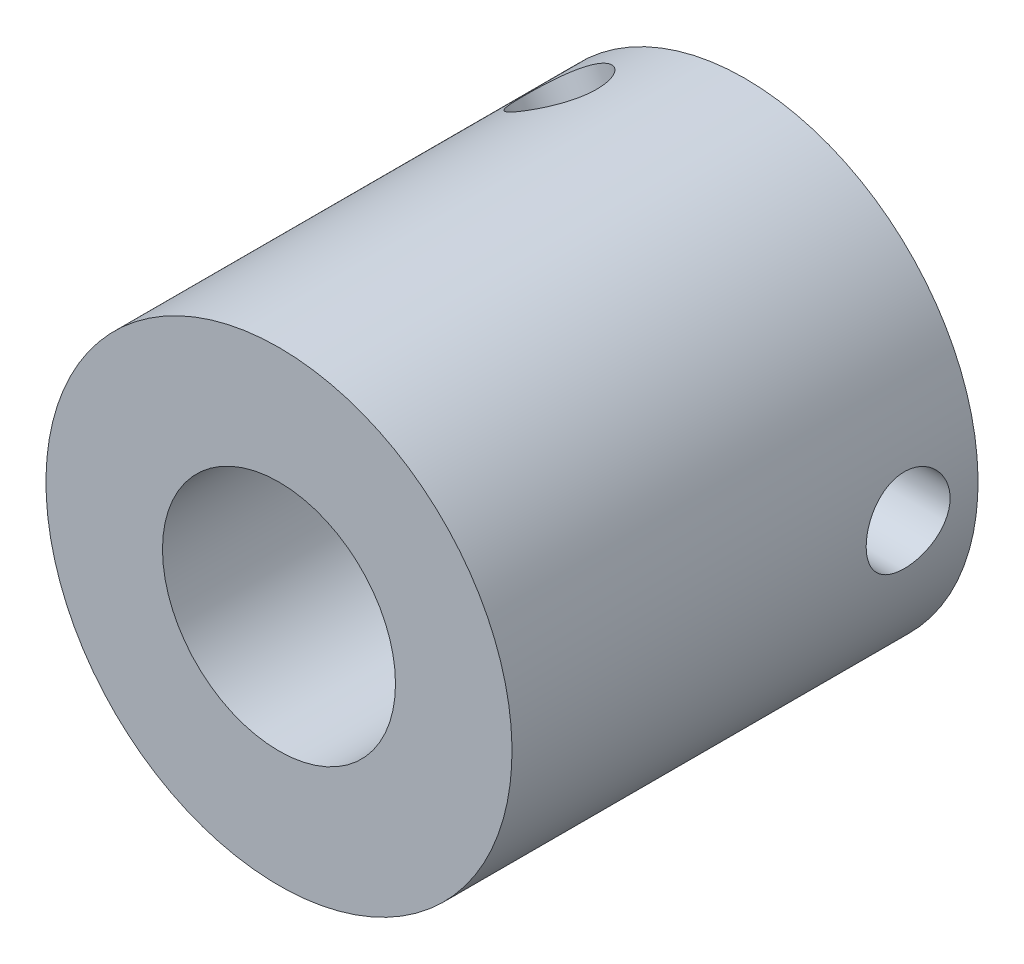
ISO-10303-21;
HEADER;
FILE_DESCRIPTION(('STEP AP214'),'2;1');
FILE_NAME('part.step','',(''),(''),'','','');
FILE_SCHEMA(('AUTOMOTIVE_DESIGN { 1 0 10303 214 1 1 1 1 }'));
ENDSEC;
DATA;
#1=APPLICATION_CONTEXT('core data for automotive mechanical design processes');
#2=APPLICATION_PROTOCOL_DEFINITION('international standard','automotive_design',2000,#1);
#3=PRODUCT_CONTEXT('',#1,'mechanical');
#4=PRODUCT('Part','Part','',(#3));
#5=PRODUCT_RELATED_PRODUCT_CATEGORY('part','',(#4));
#6=PRODUCT_DEFINITION_FORMATION('','',#4);
#7=PRODUCT_DEFINITION_CONTEXT('part definition',#1,'design');
#8=PRODUCT_DEFINITION('design','',#6,#7);
#9=PRODUCT_DEFINITION_SHAPE('','',#8);
#10=(LENGTH_UNIT() NAMED_UNIT(*) SI_UNIT(.MILLI.,.METRE.));
#11=(NAMED_UNIT(*) PLANE_ANGLE_UNIT() SI_UNIT($,.RADIAN.));
#12=(NAMED_UNIT(*) SI_UNIT($,.STERADIAN.) SOLID_ANGLE_UNIT());
#13=UNCERTAINTY_MEASURE_WITH_UNIT(LENGTH_MEASURE(1.E-05),#10,'distance_accuracy_value','');
#14=(GEOMETRIC_REPRESENTATION_CONTEXT(3) GLOBAL_UNCERTAINTY_ASSIGNED_CONTEXT((#13)) GLOBAL_UNIT_ASSIGNED_CONTEXT((#10,
#11,#12)) REPRESENTATION_CONTEXT('',''));
#15=CARTESIAN_POINT('',(0.,0.,0.));
#16=DIRECTION('',(0.,0.,1.));
#17=DIRECTION('',(1.,0.,0.));
#18=AXIS2_PLACEMENT_3D('',#15,#16,#17);
#19=CARTESIAN_POINT('',(10.,0.,3.));
#20=DIRECTION('',(1.,0.,0.));
#21=DIRECTION('',(0.,0.,1.));
#22=AXIS2_PLACEMENT_3D('',#19,#20,#21);
#23=CYLINDRICAL_SURFACE('',#22,1.8);
#24=CARTESIAN_POINT('',(5.,0.,4.8));
#25=CARTESIAN_POINT('',(5.00000162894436,0.0977539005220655,4.80000224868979));
#26=CARTESIAN_POINT('',(4.99710773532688,0.19549186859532,4.79201150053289));
#27=CARTESIAN_POINT('',(4.98585098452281,0.388062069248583,4.7603771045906));
#28=CARTESIAN_POINT('',(4.97748842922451,0.482894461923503,4.73673432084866));
#29=CARTESIAN_POINT('',(4.95619614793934,0.666849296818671,4.67473007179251));
#30=CARTESIAN_POINT('',(4.94327480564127,0.755981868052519,4.63639561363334));
#31=CARTESIAN_POINT('',(4.91416362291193,0.92654826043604,4.54622789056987));
#32=CARTESIAN_POINT('',(4.89797298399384,1.00798019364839,4.49439132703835));
#33=CARTESIAN_POINT('',(4.86328998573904,1.1640588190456,4.37654202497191));
#34=CARTESIAN_POINT('',(4.84473608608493,1.23835945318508,4.31008922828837));
#35=CARTESIAN_POINT('',(4.8077334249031,1.37503534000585,4.16582831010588));
#36=CARTESIAN_POINT('',(4.78928469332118,1.43740734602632,4.08801710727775));
#37=CARTESIAN_POINT('',(4.75387995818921,1.55057074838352,3.91996655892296));
#38=CARTESIAN_POINT('',(4.73699749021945,1.60088792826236,3.82939085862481));
#39=CARTESIAN_POINT('',(4.70758621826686,1.6854228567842,3.64035790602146));
#40=CARTESIAN_POINT('',(4.69505583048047,1.71964646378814,3.54190353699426));
#41=CARTESIAN_POINT('',(4.6764216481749,1.76968160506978,3.34387619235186));
#42=CARTESIAN_POINT('',(4.67008963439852,1.78614945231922,3.24449121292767));
#43=CARTESIAN_POINT('',(4.66389839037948,1.80225793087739,3.0441824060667));
#44=CARTESIAN_POINT('',(4.66403674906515,1.80190483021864,2.94325916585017));
#45=CARTESIAN_POINT('',(4.67057263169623,1.78488611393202,2.74858544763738));
#46=CARTESIAN_POINT('',(4.67662885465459,1.76910996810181,2.65474367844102));
#47=CARTESIAN_POINT('',(4.69375412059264,1.7231561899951,2.47114129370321));
#48=CARTESIAN_POINT('',(4.70482385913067,1.69297655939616,2.38138124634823));
#49=CARTESIAN_POINT('',(4.73094806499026,1.61855003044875,2.20660082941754));
#50=CARTESIAN_POINT('',(4.74607046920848,1.57406042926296,2.12169440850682));
#51=CARTESIAN_POINT('',(4.77857129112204,1.47244565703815,1.96028560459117));
#52=CARTESIAN_POINT('',(4.79595044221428,1.41531637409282,1.88378596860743));
#53=CARTESIAN_POINT('',(4.83231258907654,1.2858992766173,1.73640984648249));
#54=CARTESIAN_POINT('',(4.85132846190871,1.21289487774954,1.66616928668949));
#55=CARTESIAN_POINT('',(4.88789590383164,1.05591731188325,1.53874730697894));
#56=CARTESIAN_POINT('',(4.90544728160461,0.971942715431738,1.48156759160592));
#57=CARTESIAN_POINT('',(4.9374100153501,0.793888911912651,1.38126165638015));
#58=CARTESIAN_POINT('',(4.95177667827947,0.699690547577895,1.33833171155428));
#59=CARTESIAN_POINT('',(4.97542272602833,0.504764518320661,1.26913413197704));
#60=CARTESIAN_POINT('',(4.9847041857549,0.404039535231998,1.2428597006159));
#61=CARTESIAN_POINT('',(4.99677710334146,0.204283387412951,1.20890559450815));
#62=CARTESIAN_POINT('',(4.99986753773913,0.10541586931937,1.20036852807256));
#63=CARTESIAN_POINT('',(5.00012395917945,-0.092375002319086,1.19965509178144));
#64=CARTESIAN_POINT('',(4.997291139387,-0.191298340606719,1.2074754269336));
#65=CARTESIAN_POINT('',(4.98621692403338,-0.382789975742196,1.23859238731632));
#66=CARTESIAN_POINT('',(4.97816730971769,-0.47545961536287,1.26134058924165));
#67=CARTESIAN_POINT('',(4.95766056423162,-0.655612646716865,1.32095908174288));
#68=CARTESIAN_POINT('',(4.9452028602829,-0.743095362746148,1.35783120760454));
#69=CARTESIAN_POINT('',(4.916682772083,-0.913170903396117,1.44579751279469));
#70=CARTESIAN_POINT('',(4.90052802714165,-0.995554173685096,1.49726600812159));
#71=CARTESIAN_POINT('',(4.86641871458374,-1.15078022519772,1.61253526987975));
#72=CARTESIAN_POINT('',(4.84846352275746,-1.22361967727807,1.6763403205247));
#73=CARTESIAN_POINT('',(4.811551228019,-1.3617486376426,1.81848564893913));
#74=CARTESIAN_POINT('',(4.7925917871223,-1.42642787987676,1.89741985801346));
#75=CARTESIAN_POINT('',(4.75675694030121,-1.54172624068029,2.06541026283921));
#76=CARTESIAN_POINT('',(4.73988164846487,-1.5923445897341,2.15446701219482));
#77=CARTESIAN_POINT('',(4.71023855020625,-1.67801139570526,2.34061713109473));
#78=CARTESIAN_POINT('',(4.69747699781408,-1.71303617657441,2.43772245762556));
#79=CARTESIAN_POINT('',(4.6778137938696,-1.76603303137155,2.63703300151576));
#80=CARTESIAN_POINT('',(4.67090889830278,-1.78401454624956,2.73923536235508));
#81=CARTESIAN_POINT('',(4.66414933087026,-1.80160793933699,2.93928552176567));
#82=CARTESIAN_POINT('',(4.66389931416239,-1.80224993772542,3.03703021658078));
#83=CARTESIAN_POINT('',(4.66947753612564,-1.7877467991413,3.2311552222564));
#84=CARTESIAN_POINT('',(4.67530528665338,-1.77260293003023,3.32753564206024));
#85=CARTESIAN_POINT('',(4.69206559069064,-1.7277347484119,3.51367900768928));
#86=CARTESIAN_POINT('',(4.70286203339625,-1.69839819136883,3.60354868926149));
#87=CARTESIAN_POINT('',(4.72827416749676,-1.62630780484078,3.77715042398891));
#88=CARTESIAN_POINT('',(4.74289078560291,-1.58355071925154,3.86088098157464));
#89=CARTESIAN_POINT('',(4.77519415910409,-1.48338009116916,4.02431309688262));
#90=CARTESIAN_POINT('',(4.79299679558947,-1.42534759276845,4.10361214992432));
#91=CARTESIAN_POINT('',(4.82923722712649,-1.29726372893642,4.25167713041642));
#92=CARTESIAN_POINT('',(4.84767521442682,-1.22720869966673,4.32043983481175));
#93=CARTESIAN_POINT('',(4.88417774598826,-1.07301971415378,4.44885088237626));
#94=CARTESIAN_POINT('',(4.90218131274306,-0.988369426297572,4.50789912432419));
#95=CARTESIAN_POINT('',(4.93483332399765,-0.809724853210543,4.61089182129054));
#96=CARTESIAN_POINT('',(4.94948194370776,-0.715731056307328,4.65483706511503));
#97=CARTESIAN_POINT('',(4.97387564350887,-0.519977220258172,4.72643874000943));
#98=CARTESIAN_POINT('',(4.98356860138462,-0.418147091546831,4.75392253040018));
#99=CARTESIAN_POINT('',(4.99662861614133,-0.21087080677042,4.79069825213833));
#100=CARTESIAN_POINT('',(4.99999824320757,-0.105426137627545,4.79999757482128));
#101=CARTESIAN_POINT('',(5.,0.,4.8));
#102=B_SPLINE_CURVE_WITH_KNOTS('',3,(#24,#25,#26,#27,#28,#29,#30,#31,#32,#33,#34,#35,#36,#37,
#38,#39,#40,#41,#42,#43,#44,#45,#46,#47,#48,#49,#50,#51,#52,#53,#54,#55,#56,#57,#58,#59,#60,#61,
#62,#63,#64,#65,#66,#67,#68,#69,#70,#71,#72,#73,#74,#75,#76,#77,#78,#79,#80,#81,#82,#83,#84,#85,
#86,#87,#88,#89,#90,#91,#92,#93,#94,#95,#96,#97,#98,#99,#100,#101),.UNSPECIFIED.,.T.,.F.,(4,2,2,
2,2,2,2,2,2,2,2,2,2,2,2,2,2,2,2,2,2,2,2,2,2,2,2,2,2,2,2,2,2,2,2,2,2,2,4),(0.,0.292873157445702,
0.585730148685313,0.87805135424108,1.17044404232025,1.47327609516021,1.77619045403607,
2.08956388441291,2.40282315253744,2.70405814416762,3.00518088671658,3.28990369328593,
3.57466601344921,3.86453804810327,4.15450452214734,4.46231862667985,4.77017288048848,
5.08210674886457,5.39391324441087,5.69025938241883,5.98654583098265,6.27251452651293,
6.55852039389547,6.85265234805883,7.14688663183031,7.45682137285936,7.76677307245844,
8.07719378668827,8.38744244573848,8.67921628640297,8.97096669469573,9.25516146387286,
9.5394252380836,9.83771174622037,10.136089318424,10.4488683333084,10.7616310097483,
11.0776188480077,11.3934782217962),.UNSPECIFIED.);
#103=CARTESIAN_POINT('',(5.,0.,4.8));
#104=VERTEX_POINT('',#103);
#105=EDGE_CURVE('E37',#104,#104,#102,.T.);
#106=ORIENTED_EDGE('',*,*,#105,.T.);
#107=EDGE_LOOP('',(#106));
#108=FACE_BOUND('',#107,.T.);
#109=CARTESIAN_POINT('',(10.,0.,1.2));
#110=CARTESIAN_POINT('',(9.99999792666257,-0.100138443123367,1.20000468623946));
#111=CARTESIAN_POINT('',(9.99847890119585,-0.200403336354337,1.20839204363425));
#112=CARTESIAN_POINT('',(9.99256124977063,-0.398189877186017,1.2417225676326));
#113=CARTESIAN_POINT('',(9.98815683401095,-0.495705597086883,1.26669902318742));
#114=CARTESIAN_POINT('',(9.97696172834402,-0.684989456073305,1.33242473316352));
#115=CARTESIAN_POINT('',(9.9701741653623,-0.776764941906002,1.37315332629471));
#116=CARTESIAN_POINT('',(9.95495763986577,-0.952142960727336,1.46917704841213));
#117=CARTESIAN_POINT('',(9.9465292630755,-1.03574839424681,1.52446698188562));
#118=CARTESIAN_POINT('',(9.92885621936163,-1.19338882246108,1.64870648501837));
#119=CARTESIAN_POINT('',(9.91960421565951,-1.26731946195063,1.7177874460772));
#120=CARTESIAN_POINT('',(9.90138142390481,-1.40261092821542,1.86736851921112));
#121=CARTESIAN_POINT('',(9.89241066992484,-1.46397023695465,1.94787000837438));
#122=CARTESIAN_POINT('',(9.87569637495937,-1.57279517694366,2.11872462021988));
#123=CARTESIAN_POINT('',(9.86796217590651,-1.6201571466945,2.20914476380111));
#124=CARTESIAN_POINT('',(9.85469826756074,-1.69897904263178,2.39681974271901));
#125=CARTESIAN_POINT('',(9.84916836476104,-1.73044036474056,2.49407397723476));
#126=CARTESIAN_POINT('',(9.84101185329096,-1.77623939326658,2.6915561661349));
#127=CARTESIAN_POINT('',(9.8383548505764,-1.79075649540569,2.79174123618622));
#128=CARTESIAN_POINT('',(9.83615323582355,-1.80281159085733,2.99315783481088));
#129=CARTESIAN_POINT('',(9.83660837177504,-1.80035095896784,3.09438927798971));
#130=CARTESIAN_POINT('',(9.84055190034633,-1.77866619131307,3.29373143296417));
#131=CARTESIAN_POINT('',(9.84400352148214,-1.75964526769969,3.39186508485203));
#132=CARTESIAN_POINT('',(9.85349347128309,-1.70569919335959,3.5835259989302));
#133=CARTESIAN_POINT('',(9.85953192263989,-1.67077328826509,3.67705304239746));
#134=CARTESIAN_POINT('',(9.87355429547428,-1.58580593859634,3.85744754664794));
#135=CARTESIAN_POINT('',(9.88154890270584,-1.53568109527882,3.94427486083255));
#136=CARTESIAN_POINT('',(9.89857482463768,-1.42180184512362,4.10835629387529));
#137=CARTESIAN_POINT('',(9.90760615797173,-1.35804719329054,4.18561024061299));
#138=CARTESIAN_POINT('',(9.92584751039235,-1.21763063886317,4.32952111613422));
#139=CARTESIAN_POINT('',(9.93505823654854,-1.14079701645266,4.39601049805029));
#140=CARTESIAN_POINT('',(9.95250580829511,-0.976936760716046,4.51520980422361));
#141=CARTESIAN_POINT('',(9.96074222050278,-0.889905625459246,4.56791360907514));
#142=CARTESIAN_POINT('',(9.97532870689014,-0.707929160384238,4.65806284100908));
#143=CARTESIAN_POINT('',(9.98167520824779,-0.612969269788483,4.69547941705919));
#144=CARTESIAN_POINT('',(9.99172969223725,-0.418096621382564,4.75370936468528));
#145=CARTESIAN_POINT('',(9.99544322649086,-0.318194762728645,4.77455768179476));
#146=CARTESIAN_POINT('',(9.99842222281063,-0.181296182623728,4.79121663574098));
#147=CARTESIAN_POINT('',(9.99901260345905,-0.145122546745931,4.79450767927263));
#148=CARTESIAN_POINT('',(9.99980186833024,-0.0726381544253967,4.7989002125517));
#149=CARTESIAN_POINT('',(10.0000007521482,-0.0363273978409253,4.80000170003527));
#150=CARTESIAN_POINT('',(9.99999792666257,0.100138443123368,4.79999531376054));
#151=CARTESIAN_POINT('',(9.99847890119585,0.200403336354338,4.79160795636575));
#152=CARTESIAN_POINT('',(9.99256124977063,0.398189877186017,4.7582774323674));
#153=CARTESIAN_POINT('',(9.98815683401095,0.495705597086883,4.73330097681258));
#154=CARTESIAN_POINT('',(9.97696172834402,0.684989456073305,4.66757526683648));
#155=CARTESIAN_POINT('',(9.9701741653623,0.776764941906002,4.62684667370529));
#156=CARTESIAN_POINT('',(9.95495763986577,0.952142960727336,4.53082295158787));
#157=CARTESIAN_POINT('',(9.9465292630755,1.03574839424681,4.47553301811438));
#158=CARTESIAN_POINT('',(9.92885621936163,1.19338882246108,4.35129351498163));
#159=CARTESIAN_POINT('',(9.91960421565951,1.26731946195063,4.2822125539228));
#160=CARTESIAN_POINT('',(9.90138142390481,1.40261092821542,4.13263148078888));
#161=CARTESIAN_POINT('',(9.89241066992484,1.46397023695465,4.05212999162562));
#162=CARTESIAN_POINT('',(9.87569637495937,1.57279517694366,3.88127537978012));
#163=CARTESIAN_POINT('',(9.86796217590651,1.6201571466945,3.79085523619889));
#164=CARTESIAN_POINT('',(9.85469826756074,1.69897904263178,3.60318025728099));
#165=CARTESIAN_POINT('',(9.84916836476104,1.73044036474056,3.50592602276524));
#166=CARTESIAN_POINT('',(9.84101185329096,1.77623939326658,3.3084438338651));
#167=CARTESIAN_POINT('',(9.8383548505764,1.79075649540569,3.20825876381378));
#168=CARTESIAN_POINT('',(9.83615323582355,1.80281159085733,3.00684216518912));
#169=CARTESIAN_POINT('',(9.83660837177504,1.80035095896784,2.90561072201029));
#170=CARTESIAN_POINT('',(9.84055190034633,1.77866619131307,2.70626856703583));
#171=CARTESIAN_POINT('',(9.84400352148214,1.75964526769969,2.60813491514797));
#172=CARTESIAN_POINT('',(9.85349347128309,1.70569919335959,2.4164740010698));
#173=CARTESIAN_POINT('',(9.85953192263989,1.67077328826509,2.32294695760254));
#174=CARTESIAN_POINT('',(9.87355429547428,1.58580593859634,2.14255245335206));
#175=CARTESIAN_POINT('',(9.88154890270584,1.53568109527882,2.05572513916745));
#176=CARTESIAN_POINT('',(9.89857482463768,1.42180184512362,1.89164370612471));
#177=CARTESIAN_POINT('',(9.90760615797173,1.35804719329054,1.81438975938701));
#178=CARTESIAN_POINT('',(9.92584751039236,1.21763063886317,1.67047888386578));
#179=CARTESIAN_POINT('',(9.93505823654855,1.14079701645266,1.60398950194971));
#180=CARTESIAN_POINT('',(9.95250580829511,0.976936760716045,1.48479019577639));
#181=CARTESIAN_POINT('',(9.96074222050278,0.889905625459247,1.43208639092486));
#182=CARTESIAN_POINT('',(9.97532870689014,0.707929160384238,1.34193715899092));
#183=CARTESIAN_POINT('',(9.98167520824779,0.612969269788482,1.30452058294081));
#184=CARTESIAN_POINT('',(9.99172969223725,0.418096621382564,1.24629063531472));
#185=CARTESIAN_POINT('',(9.99544322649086,0.318194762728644,1.22544231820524));
#186=CARTESIAN_POINT('',(9.99842222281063,0.181296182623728,1.20878336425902));
#187=CARTESIAN_POINT('',(9.99901260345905,0.145122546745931,1.20549232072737));
#188=CARTESIAN_POINT('',(9.99980186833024,0.0726381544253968,1.2010997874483));
#189=CARTESIAN_POINT('',(10.0000007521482,0.0363273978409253,1.19999829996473));
#190=CARTESIAN_POINT('',(10.,0.,1.2));
#191=B_SPLINE_CURVE_WITH_KNOTS('',3,(#109,#110,#111,#112,#113,#114,#115,#116,#117,#118,#119,
#120,#121,#122,#123,#124,#125,#126,#127,#128,#129,#130,#131,#132,#133,#134,#135,#136,#137,#138,
#139,#140,#141,#142,#143,#144,#145,#146,#147,#148,#149,#150,#151,#152,#153,#154,#155,#156,#157,
#158,#159,#160,#161,#162,#163,#164,#165,#166,#167,#168,#169,#170,#171,#172,#173,#174,#175,#176,
#177,#178,#179,#180,#181,#182,#183,#184,#185,#186,#187,#188,#189,#190),.UNSPECIFIED.,.T.,.F.,(4,
2,2,2,2,2,2,2,2,2,2,2,2,2,2,2,2,2,2,2,2,2,2,2,2,2,2,2,2,2,2,2,2,2,2,2,2,2,2,2,4),(0.,
0.300276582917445,0.601157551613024,0.901645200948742,1.20202578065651,1.50541792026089,
1.808846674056,2.11446927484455,2.42006504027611,2.72239510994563,3.02470069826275,
3.3233481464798,3.62200976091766,3.92234077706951,4.22267719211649,4.52731338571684,
4.83208457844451,5.13742832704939,5.44212632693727,5.55105807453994,5.65998993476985,
5.9602665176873,6.26114748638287,6.56163513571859,6.86201571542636,7.16540785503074,
7.46883660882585,7.7744592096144,8.08005497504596,8.38238504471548,8.6846906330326,
8.98333808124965,9.28199969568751,9.58233071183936,9.88266712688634,10.1873033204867,
10.4920745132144,10.7974182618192,11.1021162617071,11.2110480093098,11.3199798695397),.UNSPECIFIED.);
#192=CARTESIAN_POINT('',(10.,0.,1.2));
#193=VERTEX_POINT('',#192);
#194=EDGE_CURVE('E53',#193,#193,#191,.T.);
#195=ORIENTED_EDGE('',*,*,#194,.F.);
#196=EDGE_LOOP('',(#195));
#197=FACE_BOUND('',#196,.T.);
#198=ADVANCED_FACE('F12',(#108,#197),#23,.F.);
#199=CARTESIAN_POINT('',(0.,0.,20.));
#200=DIRECTION('',(0.,0.,1.));
#201=DIRECTION('',(0.,-1.,0.));
#202=AXIS2_PLACEMENT_3D('',#199,#200,#201);
#203=PLANE('',#202);
#204=CARTESIAN_POINT('',(0.,0.,20.));
#205=DIRECTION('',(0.,0.,1.));
#206=DIRECTION('',(1.,0.,0.));
#207=AXIS2_PLACEMENT_3D('',#204,#205,#206);
#208=CIRCLE('',#207,5.);
#209=CARTESIAN_POINT('',(5.,0.,20.));
#210=VERTEX_POINT('',#209);
#211=EDGE_CURVE('E74',#210,#210,#208,.T.);
#212=ORIENTED_EDGE('',*,*,#211,.F.);
#213=EDGE_LOOP('',(#212));
#214=FACE_BOUND('',#213,.T.);
#215=CARTESIAN_POINT('',(0.,0.,20.));
#216=DIRECTION('',(0.,0.,-1.));
#217=DIRECTION('',(0.,1.,0.));
#218=AXIS2_PLACEMENT_3D('',#215,#216,#217);
#219=CIRCLE('',#218,10.);
#220=CARTESIAN_POINT('',(0.,10.,20.));
#221=VERTEX_POINT('',#220);
#222=EDGE_CURVE('E30',#221,#221,#219,.T.);
#223=ORIENTED_EDGE('',*,*,#222,.F.);
#224=EDGE_LOOP('',(#223));
#225=FACE_BOUND('',#224,.T.);
#226=ADVANCED_FACE('F61',(#214,#225),#203,.T.);
#227=CARTESIAN_POINT('',(0.,0.,0.));
#228=DIRECTION('',(0.,0.,1.));
#229=DIRECTION('',(0.,-1.,0.));
#230=AXIS2_PLACEMENT_3D('',#227,#228,#229);
#231=PLANE('',#230);
#232=CARTESIAN_POINT('',(0.,0.,0.));
#233=DIRECTION('',(0.,0.,1.));
#234=DIRECTION('',(1.,0.,0.));
#235=AXIS2_PLACEMENT_3D('',#232,#233,#234);
#236=CIRCLE('',#235,5.);
#237=CARTESIAN_POINT('',(5.,0.,0.));
#238=VERTEX_POINT('',#237);
#239=EDGE_CURVE('E76',#238,#238,#236,.T.);
#240=ORIENTED_EDGE('',*,*,#239,.T.);
#241=EDGE_LOOP('',(#240));
#242=FACE_BOUND('',#241,.T.);
#243=CARTESIAN_POINT('',(0.,0.,0.));
#244=DIRECTION('',(0.,0.,-1.));
#245=DIRECTION('',(0.,1.,0.));
#246=AXIS2_PLACEMENT_3D('',#243,#244,#245);
#247=CIRCLE('',#246,10.);
#248=CARTESIAN_POINT('',(0.,10.,0.));
#249=VERTEX_POINT('',#248);
#250=EDGE_CURVE('E25',#249,#249,#247,.F.);
#251=ORIENTED_EDGE('',*,*,#250,.F.);
#252=EDGE_LOOP('',(#251));
#253=FACE_BOUND('',#252,.T.);
#254=ADVANCED_FACE('F63',(#242,#253),#231,.F.);
#255=CARTESIAN_POINT('',(-5.,8.66025403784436,3.));
#256=DIRECTION('',(-0.5,0.866025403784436,0.));
#257=DIRECTION('',(-0.866025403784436,-0.5,0.));
#258=AXIS2_PLACEMENT_3D('',#255,#256,#257);
#259=CYLINDRICAL_SURFACE('',#258,1.8);
#260=CARTESIAN_POINT('',(-3.89122648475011,3.13980197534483,3.));
#261=CARTESIAN_POINT('',(-3.89122747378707,3.13979901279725,2.90247845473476));
#262=CARTESIAN_POINT('',(-3.88588566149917,3.14645523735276,2.80497297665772));
#263=CARTESIAN_POINT('',(-3.8646073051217,3.1725524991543,2.61288304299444));
#264=CARTESIAN_POINT('',(-3.84867037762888,3.19199399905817,2.51829869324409));
#265=CARTESIAN_POINT('',(-3.80646681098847,3.24220172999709,2.33487248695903));
#266=CARTESIAN_POINT('',(-3.78022320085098,3.27294270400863,2.24601833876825));
#267=CARTESIAN_POINT('',(-3.71767295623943,3.3438203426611,2.07592991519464));
#268=CARTESIAN_POINT('',(-3.68136357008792,3.38395957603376,1.99469773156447));
#269=CARTESIAN_POINT('',(-3.59725267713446,3.47328119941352,1.83844389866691));
#270=CARTESIAN_POINT('',(-3.54903622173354,3.52277012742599,1.76382074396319));
#271=CARTESIAN_POINT('',(-3.4423905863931,3.62705163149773,1.62650840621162));
#272=CARTESIAN_POINT('',(-3.38395944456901,3.68184522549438,1.56382152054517));
#273=CARTESIAN_POINT('',(-3.25553209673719,3.79593239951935,1.45028357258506));
#274=CARTESIAN_POINT('',(-3.18523343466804,3.85531283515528,1.39985984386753));
#275=CARTESIAN_POINT('',(-3.03560156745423,3.97419621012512,1.31512692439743));
#276=CARTESIAN_POINT('',(-2.95627124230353,4.03369910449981,1.28081261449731));
#277=CARTESIAN_POINT('',(-2.79374684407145,4.14782328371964,1.23065284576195));
#278=CARTESIAN_POINT('',(-2.7108348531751,4.20254463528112,1.21412260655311));
#279=CARTESIAN_POINT('',(-2.54067690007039,4.30754492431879,1.197812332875));
#280=CARTESIAN_POINT('',(-2.45343224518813,4.35782518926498,1.19802727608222));
#281=CARTESIAN_POINT('',(-2.2813937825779,4.45020762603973,1.21478918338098));
#282=CARTESIAN_POINT('',(-2.19666990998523,4.49257835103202,1.23059012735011));
#283=CARTESIAN_POINT('',(-2.02833233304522,4.57104984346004,1.27682852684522));
#284=CARTESIAN_POINT('',(-1.94471870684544,4.6071501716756,1.30726700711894));
#285=CARTESIAN_POINT('',(-1.7799513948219,4.67330425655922,1.3822951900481));
#286=CARTESIAN_POINT('',(-1.69884909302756,4.70326546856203,1.42707858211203));
#287=CARTESIAN_POINT('',(-1.54276654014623,4.75675187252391,1.52935870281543));
#288=CARTESIAN_POINT('',(-1.46778818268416,4.78027507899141,1.58685934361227));
#289=CARTESIAN_POINT('',(-1.32235790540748,4.82259435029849,1.71659889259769));
#290=CARTESIAN_POINT('',(-1.25237303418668,4.84106426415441,1.78946867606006));
#291=CARTESIAN_POINT('',(-1.12420364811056,4.87242549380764,1.94602011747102));
#292=CARTESIAN_POINT('',(-1.0660216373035,4.88531562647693,2.02970406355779));
#293=CARTESIAN_POINT('',(-0.96288381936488,4.90669867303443,2.20758130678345));
#294=CARTESIAN_POINT('',(-0.918200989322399,4.91510317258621,2.30194439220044));
#295=CARTESIAN_POINT('',(-0.845904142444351,4.92806364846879,2.49723850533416));
#296=CARTESIAN_POINT('',(-0.818281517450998,4.93262156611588,2.59816619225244));
#297=CARTESIAN_POINT('',(-0.782686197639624,4.93839170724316,2.79815389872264));
#298=CARTESIAN_POINT('',(-0.773773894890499,4.93976429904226,2.89704196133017));
#299=CARTESIAN_POINT('',(-0.773305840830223,4.93983813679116,3.09484795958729));
#300=CARTESIAN_POINT('',(-0.781746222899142,4.93853997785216,3.19376588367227));
#301=CARTESIAN_POINT('',(-0.814746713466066,4.9331980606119,3.38443869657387));
#302=CARTESIAN_POINT('',(-0.838608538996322,4.92927298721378,3.47631949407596));
#303=CARTESIAN_POINT('',(-0.900561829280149,4.91833009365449,3.65494767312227));
#304=CARTESIAN_POINT('',(-0.938656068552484,4.91131167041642,3.74169404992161));
#305=CARTESIAN_POINT('',(-1.0289969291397,4.89319462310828,3.91100910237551));
#306=CARTESIAN_POINT('',(-1.08169771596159,4.88196007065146,3.9933203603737));
#307=CARTESIAN_POINT('',(-1.1985231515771,4.85459952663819,4.14849310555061));
#308=CARTESIAN_POINT('',(-1.26265168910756,4.83847186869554,4.22135136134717));
#309=CARTESIAN_POINT('',(-1.40413758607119,4.79938321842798,4.35989644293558));
#310=CARTESIAN_POINT('',(-1.48204407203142,4.7760822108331,4.4249287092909));
#311=CARTESIAN_POINT('',(-1.64552242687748,4.72225068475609,4.54085834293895));
#312=CARTESIAN_POINT('',(-1.73109418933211,4.69172026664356,4.59175590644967));
#313=CARTESIAN_POINT('',(-1.90656947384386,4.62318195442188,4.67757481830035));
#314=CARTESIAN_POINT('',(-1.99644974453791,4.58521138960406,4.71257314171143));
#315=CARTESIAN_POINT('',(-2.17778192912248,4.50191081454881,4.76560985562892));
#316=CARTESIAN_POINT('',(-2.26923315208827,4.4565839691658,4.78365551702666));
#317=CARTESIAN_POINT('',(-2.44558841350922,4.36217374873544,4.80153748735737));
#318=CARTESIAN_POINT('',(-2.53057880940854,4.31342674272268,4.802307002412));
#319=CARTESIAN_POINT('',(-2.69655577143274,4.21165766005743,4.7879786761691));
#320=CARTESIAN_POINT('',(-2.77754275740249,4.15863603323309,4.77288250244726));
#321=CARTESIAN_POINT('',(-2.93173519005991,4.05136693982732,4.72789571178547));
#322=CARTESIAN_POINT('',(-3.00506854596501,3.99716876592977,4.69832318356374));
#323=CARTESIAN_POINT('',(-3.14439654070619,3.88851948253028,4.6255308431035));
#324=CARTESIAN_POINT('',(-3.21038979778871,3.83406832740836,4.58230846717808));
#325=CARTESIAN_POINT('',(-3.336550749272,3.72487212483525,4.48144809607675));
#326=CARTESIAN_POINT('',(-3.39637551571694,3.67020402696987,4.42329838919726));
#327=CARTESIAN_POINT('',(-3.50635300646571,3.56528759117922,4.29506354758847));
#328=CARTESIAN_POINT('',(-3.55650238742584,3.51504078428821,4.22497430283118));
#329=CARTESIAN_POINT('',(-3.64884949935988,3.41914369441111,4.07087091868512));
#330=CARTESIAN_POINT('',(-3.69055452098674,3.37382648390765,3.98635242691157));
#331=CARTESIAN_POINT('',(-3.76249653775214,3.29340906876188,3.8080547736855));
#332=CARTESIAN_POINT('',(-3.79273401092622,3.25830843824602,3.71427599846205));
#333=CARTESIAN_POINT('',(-3.84165865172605,3.20048782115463,3.51895568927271));
#334=CARTESIAN_POINT('',(-3.86022328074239,3.17789946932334,3.41734397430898));
#335=CARTESIAN_POINT('',(-3.88500342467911,3.14756203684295,3.21048064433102));
#336=CARTESIAN_POINT('',(-3.89122541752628,3.13980517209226,3.10523096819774));
#337=CARTESIAN_POINT('',(-3.89122648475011,3.13980197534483,3.));
#338=B_SPLINE_CURVE_WITH_KNOTS('',3,(#260,#261,#262,#263,#264,#265,#266,#267,#268,#269,#270,
#271,#272,#273,#274,#275,#276,#277,#278,#279,#280,#281,#282,#283,#284,#285,#286,#287,#288,#289,
#290,#291,#292,#293,#294,#295,#296,#297,#298,#299,#300,#301,#302,#303,#304,#305,#306,#307,#308,
#309,#310,#311,#312,#313,#314,#315,#316,#317,#318,#319,#320,#321,#322,#323,#324,#325,#326,#327,
#328,#329,#330,#331,#332,#333,#334,#335,#336,#337),.UNSPECIFIED.,.T.,.F.,(4,2,2,2,2,2,2,2,2,2,2,
2,2,2,2,2,2,2,2,2,2,2,2,2,2,2,2,2,2,2,2,2,2,2,2,2,2,2,4),(0.,0.292173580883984,
0.584357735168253,0.875892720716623,1.16750748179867,1.47124350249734,1.77503792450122,
2.08825346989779,2.40136941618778,2.70194221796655,3.00242487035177,3.28919020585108,
3.575975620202,3.86680921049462,4.15773239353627,4.46445707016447,4.77124675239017,
5.08387886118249,5.3963530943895,5.69271819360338,5.98901726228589,6.27275971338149,
6.5565575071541,6.85042427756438,7.14439123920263,7.45528614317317,7.76617673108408,
8.0755456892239,8.38478190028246,8.67727138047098,8.96973012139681,9.25603305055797,
9.54238978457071,9.84031183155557,10.1383366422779,10.4505611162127,10.7627725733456,
11.0782091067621,11.3934800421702),.UNSPECIFIED.);
#339=CARTESIAN_POINT('',(-3.89122648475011,3.13980197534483,3.));
#340=VERTEX_POINT('',#339);
#341=EDGE_CURVE('E16',#340,#340,#338,.T.);
#342=ORIENTED_EDGE('',*,*,#341,.T.);
#343=EDGE_LOOP('',(#342));
#344=FACE_BOUND('',#343,.T.);
#345=CARTESIAN_POINT('',(-6.4771787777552,7.6188027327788,3.));
#346=CARTESIAN_POINT('',(-6.47717580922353,7.61880698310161,2.89987639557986));
#347=CARTESIAN_POINT('',(-6.47068644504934,7.62433700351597,2.79962624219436));
#348=CARTESIAN_POINT('',(-6.44483457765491,7.64620053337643,2.60187040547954));
#349=CARTESIAN_POINT('',(-6.42544614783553,7.66255580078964,2.50437066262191));
#350=CARTESIAN_POINT('',(-6.37421453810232,7.70522498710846,2.31512059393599));
#351=CARTESIAN_POINT('',(-6.34238797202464,7.7315256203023,2.22336278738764));
#352=CARTESIAN_POINT('',(-6.26693437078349,7.79280979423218,2.04801451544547));
#353=CARTESIAN_POINT('',(-6.22331151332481,7.82779026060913,1.96442117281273));
#354=CARTESIAN_POINT('',(-6.1246056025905,7.90526230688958,1.8067676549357));
#355=CARTESIAN_POINT('',(-6.06940820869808,7.94782813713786,1.73281553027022));
#356=CARTESIAN_POINT('',(-5.94895032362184,8.03838649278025,1.5974824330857));
#357=CARTESIAN_POINT('',(-5.8836886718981,8.08637964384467,1.5361029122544));
#358=CARTESIAN_POINT('',(-5.74401420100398,8.18619010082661,1.42725636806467));
#359=CARTESIAN_POINT('',(-5.66954069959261,8.2380317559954,1.37988942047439));
#360=CARTESIAN_POINT('',(-5.5135724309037,8.34322213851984,1.30105739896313));
#361=CARTESIAN_POINT('',(-5.43207825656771,8.39657073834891,1.26959098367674));
#362=CARTESIAN_POINT('',(-5.26508535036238,8.50226626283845,1.22378199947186));
#363=CARTESIAN_POINT('',(-5.17963895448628,8.55461779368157,1.20925935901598));
#364=CARTESIAN_POINT('',(-5.00630940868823,8.6571937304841,1.19718952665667));
#365=CARTESIAN_POINT('',(-4.91842644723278,8.70741830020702,1.19964102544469));
#366=CARTESIAN_POINT('',(-4.74381824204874,8.80375038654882,1.22131086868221));
#367=CARTESIAN_POINT('',(-4.65709135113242,8.84989875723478,1.24033521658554));
#368=CARTESIAN_POINT('',(-4.48634526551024,8.93766900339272,1.29430467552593));
#369=CARTESIAN_POINT('',(-4.40232618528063,8.97929068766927,1.3292504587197));
#370=CARTESIAN_POINT('',(-4.23910830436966,9.05749423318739,1.41425989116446));
#371=CARTESIAN_POINT('',(-4.15993732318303,9.09404829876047,1.46440245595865));
#372=CARTESIAN_POINT('',(-4.00935476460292,9.16143489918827,1.57832003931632));
#373=CARTESIAN_POINT('',(-3.93794332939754,9.19226732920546,1.64209530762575));
#374=CARTESIAN_POINT('',(-3.80421461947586,9.24842115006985,1.78252710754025));
#375=CARTESIAN_POINT('',(-3.74203819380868,9.27365961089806,1.85935101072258));
#376=CARTESIAN_POINT('',(-3.63008074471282,9.31805527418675,2.02318310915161));
#377=CARTESIAN_POINT('',(-3.58030527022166,9.33720975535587,2.11019583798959));
#378=CARTESIAN_POINT('',(-3.49488097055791,9.36952004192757,2.29216608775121));
#379=CARTESIAN_POINT('',(-3.45926435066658,9.38266218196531,2.38714113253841));
#380=CARTESIAN_POINT('',(-3.40374434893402,9.40294697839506,2.58204697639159));
#381=CARTESIAN_POINT('',(-3.3838078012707,9.4101022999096,2.68196683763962));
#382=CARTESIAN_POINT('',(-3.36788185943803,9.41580493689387,2.81885406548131));
#383=CARTESIAN_POINT('',(-3.36473694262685,9.41692892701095,2.85499777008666));
#384=CARTESIAN_POINT('',(-3.36053873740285,9.41842790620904,2.9274221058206));
#385=CARTESIAN_POINT('',(-3.3594854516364,9.41880289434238,2.96370273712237));
#386=CARTESIAN_POINT('',(-3.35949248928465,9.41880228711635,3.10012360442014));
#387=CARTESIAN_POINT('',(-3.36752630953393,9.41594734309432,3.20037375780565));
#388=CARTESIAN_POINT('',(-3.39938661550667,9.40449073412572,3.39812959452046));
#389=CARTESIAN_POINT('',(-3.42324490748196,9.39587749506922,3.49562933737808));
#390=CARTESIAN_POINT('',(-3.48581331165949,9.37284421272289,3.68487940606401));
#391=CARTESIAN_POINT('',(-3.52450361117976,9.35843191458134,3.77663721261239));
#392=CARTESIAN_POINT('',(-3.61530406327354,9.32372926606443,3.95198548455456));
#393=CARTESIAN_POINT('',(-3.66740946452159,9.303440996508,4.03557882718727));
#394=CARTESIAN_POINT('',(-3.7838551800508,9.25669519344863,4.1932323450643));
#395=CARTESIAN_POINT('',(-3.84831696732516,9.23017576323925,4.26718446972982));
#396=CARTESIAN_POINT('',(-3.98697174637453,9.17113535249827,4.40251756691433));
#397=CARTESIAN_POINT('',(-4.06116586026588,9.13861367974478,4.4638970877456));
#398=CARTESIAN_POINT('',(-4.21744148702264,9.06755726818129,4.57274363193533));
#399=CARTESIAN_POINT('',(-4.29957442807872,9.02898215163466,4.62011057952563));
#400=CARTESIAN_POINT('',(-4.46865610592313,8.94650486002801,4.6989426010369));
#401=CARTESIAN_POINT('',(-4.55560443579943,8.90260313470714,4.73040901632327));
#402=CARTESIAN_POINT('',(-4.73063589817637,8.81083079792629,4.77621800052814));
#403=CARTESIAN_POINT('',(-4.81869685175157,8.76300781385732,4.79074064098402));
#404=CARTESIAN_POINT('',(-4.99419499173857,8.66418799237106,4.80281047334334));
#405=CARTESIAN_POINT('',(-5.08163222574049,8.6131914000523,4.80035897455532));
#406=CARTESIAN_POINT('',(-5.25236236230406,8.51014230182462,4.77868913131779));
#407=CARTESIAN_POINT('',(-5.33569146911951,8.45810879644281,4.75966478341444));
#408=CARTESIAN_POINT('',(-5.4970757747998,8.35412347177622,4.70569532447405));
#409=CARTESIAN_POINT('',(-5.57513075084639,8.30217165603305,4.6707495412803));
#410=CARTESIAN_POINT('',(-5.72446594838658,8.19992259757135,4.58574010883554));
#411=CARTESIAN_POINT('',(-5.79570818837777,8.14963554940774,4.53559754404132));
#412=CARTESIAN_POINT('',(-5.92935797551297,8.0529205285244,4.42167996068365));
#413=CARTESIAN_POINT('',(-5.99176536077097,8.0064926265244,4.35790469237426));
#414=CARTESIAN_POINT('',(-6.10726035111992,7.91875707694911,4.21747289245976));
#415=CARTESIAN_POINT('',(-6.16020571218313,7.87752994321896,4.14064898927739));
#416=CARTESIAN_POINT('',(-6.25463220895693,7.80276977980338,3.97681689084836));
#417=CARTESIAN_POINT('',(-6.29610821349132,7.76924019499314,3.88980416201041));
#418=CARTESIAN_POINT('',(-6.36680189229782,7.71141572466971,3.7078339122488));
#419=CARTESIAN_POINT('',(-6.39599162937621,7.68714189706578,3.61285886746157));
#420=CARTESIAN_POINT('',(-6.44131877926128,7.64920256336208,3.41795302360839));
#421=CARTESIAN_POINT('',(-6.45748374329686,7.6355146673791,3.31803316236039));
#422=CARTESIAN_POINT('',(-6.47038534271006,7.624573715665,3.18114593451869));
#423=CARTESIAN_POINT('',(-6.47293120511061,7.6224121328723,3.14500222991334));
#424=CARTESIAN_POINT('',(-6.4763284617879,7.61952587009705,3.0725778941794));
#425=CARTESIAN_POINT('',(-6.47717985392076,7.61880119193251,3.03629726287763));
#426=CARTESIAN_POINT('',(-6.4771787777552,7.6188027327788,3.));
#427=B_SPLINE_CURVE_WITH_KNOTS('',3,(#345,#346,#347,#348,#349,#350,#351,#352,#353,#354,#355,
#356,#357,#358,#359,#360,#361,#362,#363,#364,#365,#366,#367,#368,#369,#370,#371,#372,#373,#374,
#375,#376,#377,#378,#379,#380,#381,#382,#383,#384,#385,#386,#387,#388,#389,#390,#391,#392,#393,
#394,#395,#396,#397,#398,#399,#400,#401,#402,#403,#404,#405,#406,#407,#408,#409,#410,#411,#412,
#413,#414,#415,#416,#417,#418,#419,#420,#421,#422,#423,#424,#425,#426),.UNSPECIFIED.,.T.,.F.,(4,
2,2,2,2,2,2,2,2,2,2,2,2,2,2,2,2,2,2,2,2,2,2,2,2,2,2,2,2,2,2,2,2,2,2,2,2,2,2,2,4),(0.,
0.300232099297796,0.601069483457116,0.901506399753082,1.2018370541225,1.50528752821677,
1.8087730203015,2.11437635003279,2.41995389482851,2.72225341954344,3.02452962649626,
3.32331431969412,3.62211162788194,3.92248795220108,4.22286977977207,4.52744433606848,
4.83215493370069,5.13755470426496,5.44230675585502,5.55114811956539,5.65998962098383,
5.96022172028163,6.26105910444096,6.56149602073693,6.86182667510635,7.16527714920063,
7.46876264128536,7.77436597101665,8.07994351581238,8.3822430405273,8.68451924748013,
8.98330394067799,9.28210124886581,9.58247757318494,9.88285940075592,10.1874339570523,
10.4921445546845,10.7975443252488,11.1022963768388,11.2111377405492,11.3199792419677),.UNSPECIFIED.);
#428=CARTESIAN_POINT('',(-6.4771787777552,7.6188027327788,3.));
#429=VERTEX_POINT('',#428);
#430=EDGE_CURVE('E8',#429,#429,#427,.T.);
#431=ORIENTED_EDGE('',*,*,#430,.F.);
#432=EDGE_LOOP('',(#431));
#433=FACE_BOUND('',#432,.T.);
#434=ADVANCED_FACE('F43',(#344,#433),#259,.F.);
#435=CARTESIAN_POINT('',(0.,0.,20.));
#436=DIRECTION('',(0.,0.,-1.));
#437=DIRECTION('',(0.,1.,0.));
#438=AXIS2_PLACEMENT_3D('',#435,#436,#437);
#439=CYLINDRICAL_SURFACE('',#438,10.);
#440=ORIENTED_EDGE('',*,*,#222,.T.);
#441=EDGE_LOOP('',(#440));
#442=FACE_BOUND('',#441,.T.);
#443=ORIENTED_EDGE('',*,*,#430,.T.);
#444=EDGE_LOOP('',(#443));
#445=FACE_BOUND('',#444,.T.);
#446=ORIENTED_EDGE('',*,*,#250,.T.);
#447=EDGE_LOOP('',(#446));
#448=FACE_BOUND('',#447,.T.);
#449=ORIENTED_EDGE('',*,*,#194,.T.);
#450=EDGE_LOOP('',(#449));
#451=FACE_BOUND('',#450,.T.);
#452=ADVANCED_FACE('F46',(#442,#445,#448,#451),#439,.T.);
#453=CARTESIAN_POINT('',(0.,0.,0.));
#454=DIRECTION('',(0.,0.,1.));
#455=DIRECTION('',(1.,0.,0.));
#456=AXIS2_PLACEMENT_3D('',#453,#454,#455);
#457=CYLINDRICAL_SURFACE('',#456,5.);
#458=ORIENTED_EDGE('',*,*,#341,.F.);
#459=EDGE_LOOP('',(#458));
#460=FACE_BOUND('',#459,.T.);
#461=ORIENTED_EDGE('',*,*,#239,.F.);
#462=EDGE_LOOP('',(#461));
#463=FACE_BOUND('',#462,.T.);
#464=ORIENTED_EDGE('',*,*,#211,.T.);
#465=EDGE_LOOP('',(#464));
#466=FACE_BOUND('',#465,.T.);
#467=ORIENTED_EDGE('',*,*,#105,.F.);
#468=EDGE_LOOP('',(#467));
#469=FACE_BOUND('',#468,.T.);
#470=ADVANCED_FACE('F49',(#460,#463,#466,#469),#457,.F.);
#471=CLOSED_SHELL('',(#198,#226,#254,#434,#452,#470));
#472=MANIFOLD_SOLID_BREP('B1',#471);
#473=ADVANCED_BREP_SHAPE_REPRESENTATION('',(#18,#472),#14);
#474=SHAPE_DEFINITION_REPRESENTATION(#9,#473);
ENDSEC;
END-ISO-10303-21;
